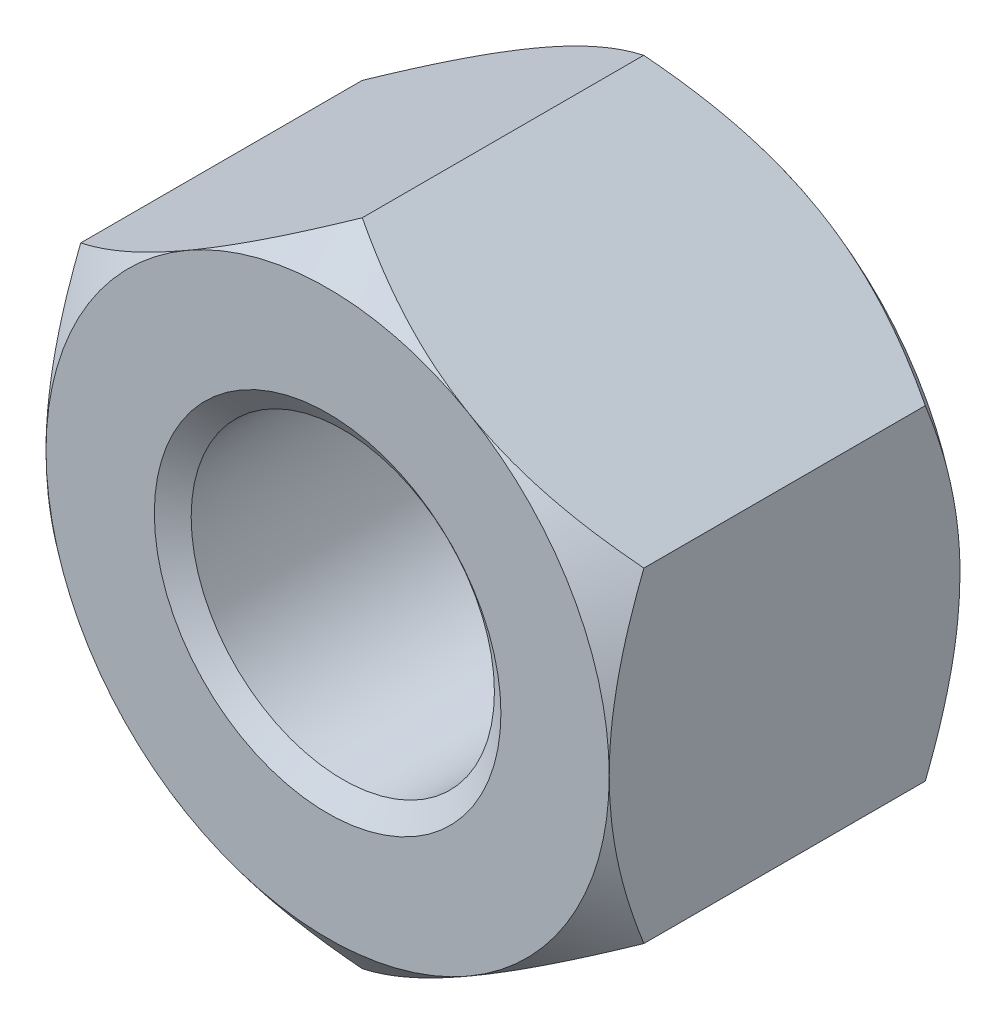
from build123d import *

# Parameters (mm, degrees)
BASENUT_START = -25.7048
BASENUTSKE_R  = 11.1125
BASENUT_DEPTH = 25.7048


with BuildPart() as part:
    # BaseNutSke → BaseNut (new body)
    with BuildSketch(Plane.XY.offset(BASENUT_START)):
        Polygon((20.6375, 11.91506618), (20.6375, -11.91506618), (0, -23.830132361), (-20.6375, -11.91506618), (-20.6375, 11.91506618), (0, 23.830132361), align=None)
        Circle(BASENUTSKE_R, mode=Mode.SUBTRACT)
    extrude(amount=BASENUT_DEPTH)

    # Sketch3 → Double-Chamfer (revolve, cut)
    with BuildSketch(Plane(origin=(0, 0, 0), x_dir=(0, 0, -1), z_dir=(1, 0, 0))):
        Polygon((25.7048, 20.6375), (23.1648, 23.830132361), (23.1648, 36.530132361), (38.4048, 36.530132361), (38.4048, 20.6375), align=None)
        Polygon((2.54, 36.530132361), (-12.7, 36.530132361), (-12.7, 20.6375), (0, 20.6375), (2.54, 23.830132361), align=None)
    revolve(axis=Axis((0, 0, 0), (0, 0, -1)), mode=Mode.SUBTRACT)

    # Sketch5 → EndChamfer (revolve, cut)
    with BuildSketch(Plane(origin=(0, 0, 0), x_dir=(0, 0, -1), z_dir=(1, 0, 0)), mode=Mode.PRIVATE) as endchamfer_sk:
        Polygon((25.6794, 12.7), (24.456662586, 10.95375), (25.7302, 10.95375), (25.7302, 12.7), align=None)
        Polygon((-0.0508, 12.7), (0, 12.7), (1.222737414, 10.95375), (-0.0508, 10.95375), align=None)
    revolve(endchamfer_sk.sketch.rotate(Axis((0, 0, -25.037505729), (0, 0, -1)), 90), axis=Axis((0, 0, -25.037505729), (0, 0, -1)), mode=Mode.SUBTRACT)


solid = part.part
